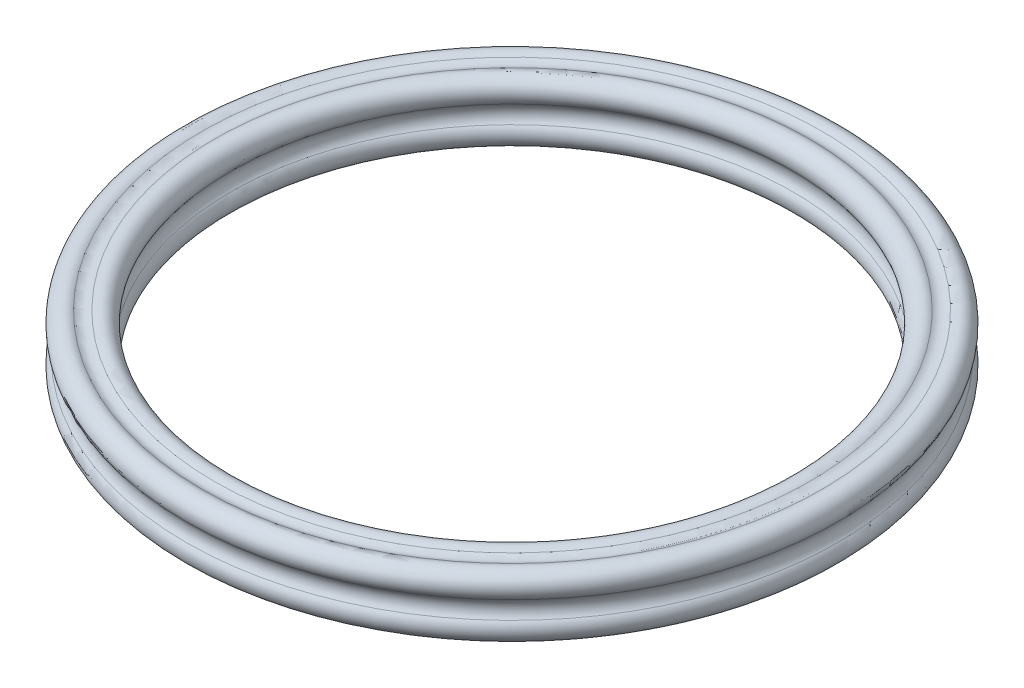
ISO-10303-21;
HEADER;
FILE_DESCRIPTION(('STEP AP214'),'2;1');
FILE_NAME('part.step','',(''),(''),'','','');
FILE_SCHEMA(('AUTOMOTIVE_DESIGN { 1 0 10303 214 1 1 1 1 }'));
ENDSEC;
DATA;
#1=APPLICATION_CONTEXT('core data for automotive mechanical design processes');
#2=APPLICATION_PROTOCOL_DEFINITION('international standard','automotive_design',2000,#1);
#3=PRODUCT_CONTEXT('',#1,'mechanical');
#4=PRODUCT('Part','Part','',(#3));
#5=PRODUCT_RELATED_PRODUCT_CATEGORY('part','',(#4));
#6=PRODUCT_DEFINITION_FORMATION('','',#4);
#7=PRODUCT_DEFINITION_CONTEXT('part definition',#1,'design');
#8=PRODUCT_DEFINITION('design','',#6,#7);
#9=PRODUCT_DEFINITION_SHAPE('','',#8);
#10=(LENGTH_UNIT() NAMED_UNIT(*) SI_UNIT(.MILLI.,.METRE.));
#11=(NAMED_UNIT(*) PLANE_ANGLE_UNIT() SI_UNIT($,.RADIAN.));
#12=(NAMED_UNIT(*) SI_UNIT($,.STERADIAN.) SOLID_ANGLE_UNIT());
#13=UNCERTAINTY_MEASURE_WITH_UNIT(LENGTH_MEASURE(1.E-05),#10,'distance_accuracy_value','');
#14=(GEOMETRIC_REPRESENTATION_CONTEXT(3) GLOBAL_UNCERTAINTY_ASSIGNED_CONTEXT((#13)) GLOBAL_UNIT_ASSIGNED_CONTEXT((#10,
#11,#12)) REPRESENTATION_CONTEXT('',''));
#15=CARTESIAN_POINT('',(0.,0.,0.));
#16=DIRECTION('',(0.,0.,1.));
#17=DIRECTION('',(1.,0.,0.));
#18=AXIS2_PLACEMENT_3D('',#15,#16,#17);
#19=CARTESIAN_POINT('',(0.,0.,0.));
#20=DIRECTION('',(0.,1.,0.));
#21=DIRECTION('',(0.,0.,1.));
#22=AXIS2_PLACEMENT_3D('',#19,#20,#21);
#23=TOROIDAL_SURFACE('',#22,17.1334523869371,0.8175);
#24=CARTESIAN_POINT('',(0.,-0.563750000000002,0.));
#25=DIRECTION('',(0.,1.,0.));
#26=DIRECTION('',(0.,0.,1.));
#27=AXIS2_PLACEMENT_3D('',#24,#25,#26);
#28=CIRCLE('',#27,17.7254761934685);
#29=CARTESIAN_POINT('',(0.,-0.563750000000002,17.7254761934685));
#30=VERTEX_POINT('',#29);
#31=EDGE_CURVE('E10',#30,#30,#28,.T.);
#32=ORIENTED_EDGE('',*,*,#31,.F.);
#33=EDGE_LOOP('',(#32));
#34=FACE_BOUND('',#33,.T.);
#35=CARTESIAN_POINT('',(0.,0.563750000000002,0.));
#36=DIRECTION('',(0.,1.,0.));
#37=DIRECTION('',(0.,0.,1.));
#38=AXIS2_PLACEMENT_3D('',#35,#36,#37);
#39=CIRCLE('',#38,17.7254761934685);
#40=CARTESIAN_POINT('',(0.,0.563750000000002,17.7254761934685));
#41=VERTEX_POINT('',#40);
#42=EDGE_CURVE('E60',#41,#41,#39,.T.);
#43=ORIENTED_EDGE('',*,*,#42,.T.);
#44=EDGE_LOOP('',(#43));
#45=FACE_BOUND('',#44,.T.);
#46=ADVANCED_FACE('F32',(#34,#45),#23,.F.);
#47=CARTESIAN_POINT('',(0.,-1.1275,0.));
#48=DIRECTION('',(0.,1.,0.));
#49=DIRECTION('',(0.,0.,1.));
#50=AXIS2_PLACEMENT_3D('',#47,#48,#49);
#51=TOROIDAL_SURFACE('',#50,18.3175,0.8175);
#52=CARTESIAN_POINT('',(0.,-1.83547576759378,0.));
#53=DIRECTION('',(0.,1.,0.));
#54=DIRECTION('',(0.,0.,1.));
#55=AXIS2_PLACEMENT_3D('',#52,#53,#54);
#56=CIRCLE('',#55,18.72625);
#57=CARTESIAN_POINT('',(0.,-1.83547576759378,18.72625));
#58=VERTEX_POINT('',#57);
#59=EDGE_CURVE('E38',#58,#58,#56,.T.);
#60=ORIENTED_EDGE('',*,*,#59,.F.);
#61=EDGE_LOOP('',(#60));
#62=FACE_BOUND('',#61,.T.);
#63=ORIENTED_EDGE('',*,*,#31,.T.);
#64=EDGE_LOOP('',(#63));
#65=FACE_BOUND('',#64,.T.);
#66=ADVANCED_FACE('F97',(#62,#65),#51,.T.);
#67=CARTESIAN_POINT('',(0.,-2.54345153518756,0.));
#68=DIRECTION('',(0.,1.,0.));
#69=DIRECTION('',(0.,0.,1.));
#70=AXIS2_PLACEMENT_3D('',#67,#68,#69);
#71=TOROIDAL_SURFACE('',#70,19.135,0.8175);
#72=CARTESIAN_POINT('',(0.,-1.83547576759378,0.));
#73=DIRECTION('',(0.,1.,0.));
#74=DIRECTION('',(0.,0.,1.));
#75=AXIS2_PLACEMENT_3D('',#72,#73,#74);
#76=CIRCLE('',#75,19.54375);
#77=CARTESIAN_POINT('',(0.,-1.83547576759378,19.54375));
#78=VERTEX_POINT('',#77);
#79=EDGE_CURVE('E42',#78,#78,#76,.T.);
#80=ORIENTED_EDGE('',*,*,#79,.F.);
#81=EDGE_LOOP('',(#80));
#82=FACE_BOUND('',#81,.T.);
#83=ORIENTED_EDGE('',*,*,#59,.T.);
#84=EDGE_LOOP('',(#83));
#85=FACE_BOUND('',#84,.T.);
#86=ADVANCED_FACE('F92',(#82,#85),#71,.F.);
#87=CARTESIAN_POINT('',(0.,-1.1275,0.));
#88=DIRECTION('',(0.,1.,0.));
#89=DIRECTION('',(0.,0.,1.));
#90=AXIS2_PLACEMENT_3D('',#87,#88,#89);
#91=TOROIDAL_SURFACE('',#90,19.9525,0.817499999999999);
#92=CARTESIAN_POINT('',(0.,-0.563750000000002,0.));
#93=DIRECTION('',(0.,1.,0.));
#94=DIRECTION('',(0.,0.,1.));
#95=AXIS2_PLACEMENT_3D('',#92,#93,#94);
#96=CIRCLE('',#95,20.5445238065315);
#97=CARTESIAN_POINT('',(0.,-0.563750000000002,20.5445238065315));
#98=VERTEX_POINT('',#97);
#99=EDGE_CURVE('E46',#98,#98,#96,.T.);
#100=ORIENTED_EDGE('',*,*,#99,.F.);
#101=EDGE_LOOP('',(#100));
#102=FACE_BOUND('',#101,.T.);
#103=ORIENTED_EDGE('',*,*,#79,.T.);
#104=EDGE_LOOP('',(#103));
#105=FACE_BOUND('',#104,.T.);
#106=ADVANCED_FACE('F86',(#102,#105),#91,.T.);
#107=CARTESIAN_POINT('',(0.,0.,0.));
#108=DIRECTION('',(0.,1.,0.));
#109=DIRECTION('',(0.,0.,1.));
#110=AXIS2_PLACEMENT_3D('',#107,#108,#109);
#111=TOROIDAL_SURFACE('',#110,21.1365476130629,0.817500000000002);
#112=CARTESIAN_POINT('',(0.,0.563750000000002,0.));
#113=DIRECTION('',(0.,1.,0.));
#114=DIRECTION('',(0.,0.,1.));
#115=AXIS2_PLACEMENT_3D('',#112,#113,#114);
#116=CIRCLE('',#115,20.5445238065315);
#117=CARTESIAN_POINT('',(0.,0.563750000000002,20.5445238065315));
#118=VERTEX_POINT('',#117);
#119=EDGE_CURVE('E51',#118,#118,#116,.T.);
#120=ORIENTED_EDGE('',*,*,#119,.F.);
#121=EDGE_LOOP('',(#120));
#122=FACE_BOUND('',#121,.T.);
#123=ORIENTED_EDGE('',*,*,#99,.T.);
#124=EDGE_LOOP('',(#123));
#125=FACE_BOUND('',#124,.T.);
#126=ADVANCED_FACE('F80',(#122,#125),#111,.F.);
#127=CARTESIAN_POINT('',(0.,1.12749999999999,0.));
#128=DIRECTION('',(0.,1.,0.));
#129=DIRECTION('',(0.,0.,1.));
#130=AXIS2_PLACEMENT_3D('',#127,#128,#129);
#131=TOROIDAL_SURFACE('',#130,19.9525,0.817499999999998);
#132=CARTESIAN_POINT('',(0.,1.83547576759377,0.));
#133=DIRECTION('',(0.,1.,0.));
#134=DIRECTION('',(0.,0.,1.));
#135=AXIS2_PLACEMENT_3D('',#132,#133,#134);
#136=CIRCLE('',#135,19.54375);
#137=CARTESIAN_POINT('',(0.,1.83547576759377,19.54375));
#138=VERTEX_POINT('',#137);
#139=EDGE_CURVE('E54',#138,#138,#136,.T.);
#140=ORIENTED_EDGE('',*,*,#139,.F.);
#141=EDGE_LOOP('',(#140));
#142=FACE_BOUND('',#141,.T.);
#143=ORIENTED_EDGE('',*,*,#119,.T.);
#144=EDGE_LOOP('',(#143));
#145=FACE_BOUND('',#144,.T.);
#146=ADVANCED_FACE('F74',(#142,#145),#131,.T.);
#147=CARTESIAN_POINT('',(0.,2.54345153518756,0.));
#148=DIRECTION('',(0.,1.,0.));
#149=DIRECTION('',(0.,0.,1.));
#150=AXIS2_PLACEMENT_3D('',#147,#148,#149);
#151=TOROIDAL_SURFACE('',#150,19.135,0.8175);
#152=CARTESIAN_POINT('',(0.,1.83547576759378,0.));
#153=DIRECTION('',(0.,1.,0.));
#154=DIRECTION('',(0.,0.,1.));
#155=AXIS2_PLACEMENT_3D('',#152,#153,#154);
#156=CIRCLE('',#155,18.72625);
#157=CARTESIAN_POINT('',(0.,1.83547576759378,18.72625));
#158=VERTEX_POINT('',#157);
#159=EDGE_CURVE('E57',#158,#158,#156,.T.);
#160=ORIENTED_EDGE('',*,*,#159,.F.);
#161=EDGE_LOOP('',(#160));
#162=FACE_BOUND('',#161,.T.);
#163=ORIENTED_EDGE('',*,*,#139,.T.);
#164=EDGE_LOOP('',(#163));
#165=FACE_BOUND('',#164,.T.);
#166=ADVANCED_FACE('F68',(#162,#165),#151,.F.);
#167=CARTESIAN_POINT('',(0.,1.1275,0.));
#168=DIRECTION('',(0.,1.,0.));
#169=DIRECTION('',(0.,0.,1.));
#170=AXIS2_PLACEMENT_3D('',#167,#168,#169);
#171=TOROIDAL_SURFACE('',#170,18.3175,0.8175);
#172=ORIENTED_EDGE('',*,*,#42,.F.);
#173=EDGE_LOOP('',(#172));
#174=FACE_BOUND('',#173,.T.);
#175=ORIENTED_EDGE('',*,*,#159,.T.);
#176=EDGE_LOOP('',(#175));
#177=FACE_BOUND('',#176,.T.);
#178=ADVANCED_FACE('F65',(#174,#177),#171,.T.);
#179=CLOSED_SHELL('',(#46,#66,#86,#106,#126,#146,#166,#178));
#180=MANIFOLD_SOLID_BREP('B2',#179);
#181=ADVANCED_BREP_SHAPE_REPRESENTATION('',(#18,#180),#14);
#182=SHAPE_DEFINITION_REPRESENTATION(#9,#181);
ENDSEC;
END-ISO-10303-21;
